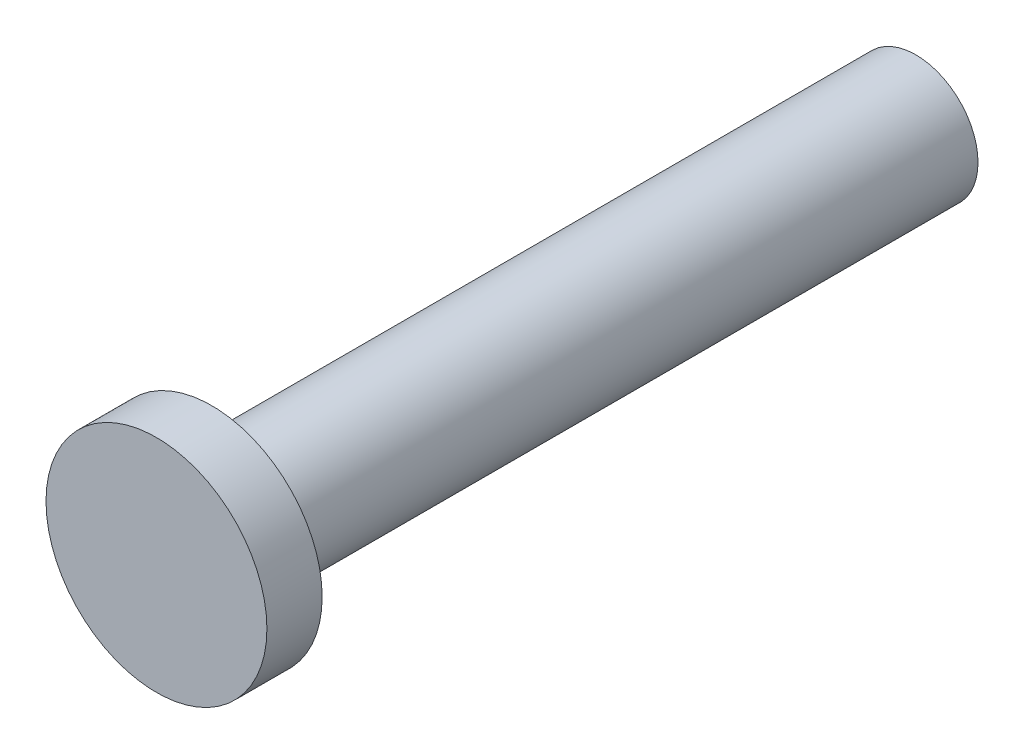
ISO-10303-21;
HEADER;
FILE_DESCRIPTION(('STEP AP214'),'2;1');
FILE_NAME('part.step','',(''),(''),'','','');
FILE_SCHEMA(('AUTOMOTIVE_DESIGN { 1 0 10303 214 1 1 1 1 }'));
ENDSEC;
DATA;
#1=APPLICATION_CONTEXT('core data for automotive mechanical design processes');
#2=APPLICATION_PROTOCOL_DEFINITION('international standard','automotive_design',2000,#1);
#3=PRODUCT_CONTEXT('',#1,'mechanical');
#4=PRODUCT('Part','Part','',(#3));
#5=PRODUCT_RELATED_PRODUCT_CATEGORY('part','',(#4));
#6=PRODUCT_DEFINITION_FORMATION('','',#4);
#7=PRODUCT_DEFINITION_CONTEXT('part definition',#1,'design');
#8=PRODUCT_DEFINITION('design','',#6,#7);
#9=PRODUCT_DEFINITION_SHAPE('','',#8);
#10=(LENGTH_UNIT() NAMED_UNIT(*) SI_UNIT(.MILLI.,.METRE.));
#11=(NAMED_UNIT(*) PLANE_ANGLE_UNIT() SI_UNIT($,.RADIAN.));
#12=(NAMED_UNIT(*) SI_UNIT($,.STERADIAN.) SOLID_ANGLE_UNIT());
#13=UNCERTAINTY_MEASURE_WITH_UNIT(LENGTH_MEASURE(1.E-05),#10,'distance_accuracy_value','');
#14=(GEOMETRIC_REPRESENTATION_CONTEXT(3) GLOBAL_UNCERTAINTY_ASSIGNED_CONTEXT((#13)) GLOBAL_UNIT_ASSIGNED_CONTEXT((#10,
#11,#12)) REPRESENTATION_CONTEXT('',''));
#15=CARTESIAN_POINT('',(0.,0.,0.));
#16=DIRECTION('',(0.,0.,1.));
#17=DIRECTION('',(1.,0.,0.));
#18=AXIS2_PLACEMENT_3D('',#15,#16,#17);
#19=CARTESIAN_POINT('',(0.,0.,51.));
#20=DIRECTION('',(0.,0.,-1.));
#21=DIRECTION('',(-1.,0.,0.));
#22=AXIS2_PLACEMENT_3D('',#19,#20,#21);
#23=CYLINDRICAL_SURFACE('',#22,4.5);
#24=CARTESIAN_POINT('',(0.,0.,51.));
#25=DIRECTION('',(0.,0.,1.));
#26=DIRECTION('',(1.,0.,0.));
#27=AXIS2_PLACEMENT_3D('',#24,#25,#26);
#28=CIRCLE('',#27,4.5);
#29=CARTESIAN_POINT('',(4.5,0.,51.));
#30=VERTEX_POINT('',#29);
#31=EDGE_CURVE('E11',#30,#30,#28,.T.);
#32=ORIENTED_EDGE('',*,*,#31,.F.);
#33=EDGE_LOOP('',(#32));
#34=FACE_BOUND('',#33,.T.);
#35=CARTESIAN_POINT('',(0.,0.,0.));
#36=DIRECTION('',(0.,0.,1.));
#37=DIRECTION('',(1.,0.,0.));
#38=AXIS2_PLACEMENT_3D('',#35,#36,#37);
#39=CIRCLE('',#38,4.5);
#40=CARTESIAN_POINT('',(4.5,0.,0.));
#41=VERTEX_POINT('',#40);
#42=EDGE_CURVE('E45',#41,#41,#39,.T.);
#43=ORIENTED_EDGE('',*,*,#42,.T.);
#44=EDGE_LOOP('',(#43));
#45=FACE_BOUND('',#44,.T.);
#46=ADVANCED_FACE('F42',(#34,#45),#23,.T.);
#47=CARTESIAN_POINT('',(0.,0.,0.));
#48=DIRECTION('',(0.,0.,1.));
#49=DIRECTION('',(1.,0.,0.));
#50=AXIS2_PLACEMENT_3D('',#47,#48,#49);
#51=PLANE('',#50);
#52=CARTESIAN_POINT('',(0.,0.,0.));
#53=DIRECTION('',(0.,0.,-1.));
#54=DIRECTION('',(-1.,0.,0.));
#55=AXIS2_PLACEMENT_3D('',#52,#53,#54);
#56=CIRCLE('',#55,2.1);
#57=CARTESIAN_POINT('',(-2.1,0.,0.));
#58=VERTEX_POINT('',#57);
#59=EDGE_CURVE('E62',#58,#58,#56,.T.);
#60=ORIENTED_EDGE('',*,*,#59,.F.);
#61=EDGE_LOOP('',(#60));
#62=FACE_BOUND('',#61,.T.);
#63=ORIENTED_EDGE('',*,*,#42,.F.);
#64=EDGE_LOOP('',(#63));
#65=FACE_BOUND('',#64,.T.);
#66=ADVANCED_FACE('F77',(#62,#65),#51,.F.);
#67=CARTESIAN_POINT('',(0.,0.,55.));
#68=DIRECTION('',(0.,0.,-1.));
#69=DIRECTION('',(-1.,0.,0.));
#70=AXIS2_PLACEMENT_3D('',#67,#68,#69);
#71=CYLINDRICAL_SURFACE('',#70,8.);
#72=CARTESIAN_POINT('',(0.,0.,55.));
#73=DIRECTION('',(0.,0.,1.));
#74=DIRECTION('',(1.,0.,0.));
#75=AXIS2_PLACEMENT_3D('',#72,#73,#74);
#76=CIRCLE('',#75,8.);
#77=CARTESIAN_POINT('',(8.,0.,55.));
#78=VERTEX_POINT('',#77);
#79=EDGE_CURVE('E65',#78,#78,#76,.T.);
#80=ORIENTED_EDGE('',*,*,#79,.F.);
#81=EDGE_LOOP('',(#80));
#82=FACE_BOUND('',#81,.T.);
#83=CARTESIAN_POINT('',(0.,0.,51.));
#84=DIRECTION('',(0.,0.,1.));
#85=DIRECTION('',(1.,0.,0.));
#86=AXIS2_PLACEMENT_3D('',#83,#84,#85);
#87=CIRCLE('',#86,8.);
#88=CARTESIAN_POINT('',(8.,0.,51.));
#89=VERTEX_POINT('',#88);
#90=EDGE_CURVE('E61',#89,#89,#87,.T.);
#91=ORIENTED_EDGE('',*,*,#90,.T.);
#92=EDGE_LOOP('',(#91));
#93=FACE_BOUND('',#92,.T.);
#94=ADVANCED_FACE('F79',(#82,#93),#71,.T.);
#95=CARTESIAN_POINT('',(0.,0.,55.));
#96=DIRECTION('',(0.,0.,1.));
#97=DIRECTION('',(1.,0.,0.));
#98=AXIS2_PLACEMENT_3D('',#95,#96,#97);
#99=PLANE('',#98);
#100=ORIENTED_EDGE('',*,*,#79,.T.);
#101=EDGE_LOOP('',(#100));
#102=FACE_BOUND('',#101,.T.);
#103=ADVANCED_FACE('F85',(#102),#99,.T.);
#104=CARTESIAN_POINT('',(0.,0.,51.));
#105=DIRECTION('',(0.,0.,1.));
#106=DIRECTION('',(1.,0.,0.));
#107=AXIS2_PLACEMENT_3D('',#104,#105,#106);
#108=PLANE('',#107);
#109=ORIENTED_EDGE('',*,*,#31,.T.);
#110=EDGE_LOOP('',(#109));
#111=FACE_BOUND('',#110,.T.);
#112=ORIENTED_EDGE('',*,*,#90,.F.);
#113=EDGE_LOOP('',(#112));
#114=FACE_BOUND('',#113,.T.);
#115=ADVANCED_FACE('F55',(#111,#114),#108,.F.);
#116=CARTESIAN_POINT('',(0.,0.,14.));
#117=DIRECTION('',(0.,0.,-1.));
#118=DIRECTION('',(-1.,0.,0.));
#119=AXIS2_PLACEMENT_3D('',#116,#117,#118);
#120=CONICAL_SURFACE('',#119,2.1,1.02974425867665);
#121=CARTESIAN_POINT('',(0.,0.,15.2618072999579));
#122=VERTEX_POINT('',#121);
#123=VERTEX_LOOP('',#122);
#124=FACE_BOUND('',#123,.T.);
#125=CARTESIAN_POINT('',(0.,0.,14.));
#126=DIRECTION('',(0.,0.,-1.));
#127=DIRECTION('',(-1.,0.,0.));
#128=AXIS2_PLACEMENT_3D('',#125,#126,#127);
#129=CIRCLE('',#128,2.1);
#130=CARTESIAN_POINT('',(-2.1,0.,14.));
#131=VERTEX_POINT('',#130);
#132=EDGE_CURVE('E59',#131,#131,#129,.T.);
#133=ORIENTED_EDGE('',*,*,#132,.T.);
#134=EDGE_LOOP('',(#133));
#135=FACE_BOUND('',#134,.T.);
#136=ADVANCED_FACE('F51',(#124,#135),#120,.F.);
#137=CARTESIAN_POINT('',(0.,0.,0.));
#138=DIRECTION('',(0.,0.,-1.));
#139=DIRECTION('',(-1.,0.,0.));
#140=AXIS2_PLACEMENT_3D('',#137,#138,#139);
#141=CYLINDRICAL_SURFACE('',#140,2.1);
#142=ORIENTED_EDGE('',*,*,#132,.F.);
#143=EDGE_LOOP('',(#142));
#144=FACE_BOUND('',#143,.T.);
#145=ORIENTED_EDGE('',*,*,#59,.T.);
#146=EDGE_LOOP('',(#145));
#147=FACE_BOUND('',#146,.T.);
#148=ADVANCED_FACE('F54',(#144,#147),#141,.F.);
#149=CLOSED_SHELL('',(#46,#66,#94,#103,#115,#136,#148));
#150=MANIFOLD_SOLID_BREP('B2',#149);
#151=ADVANCED_BREP_SHAPE_REPRESENTATION('',(#18,#150),#14);
#152=SHAPE_DEFINITION_REPRESENTATION(#9,#151);
ENDSEC;
END-ISO-10303-21;
